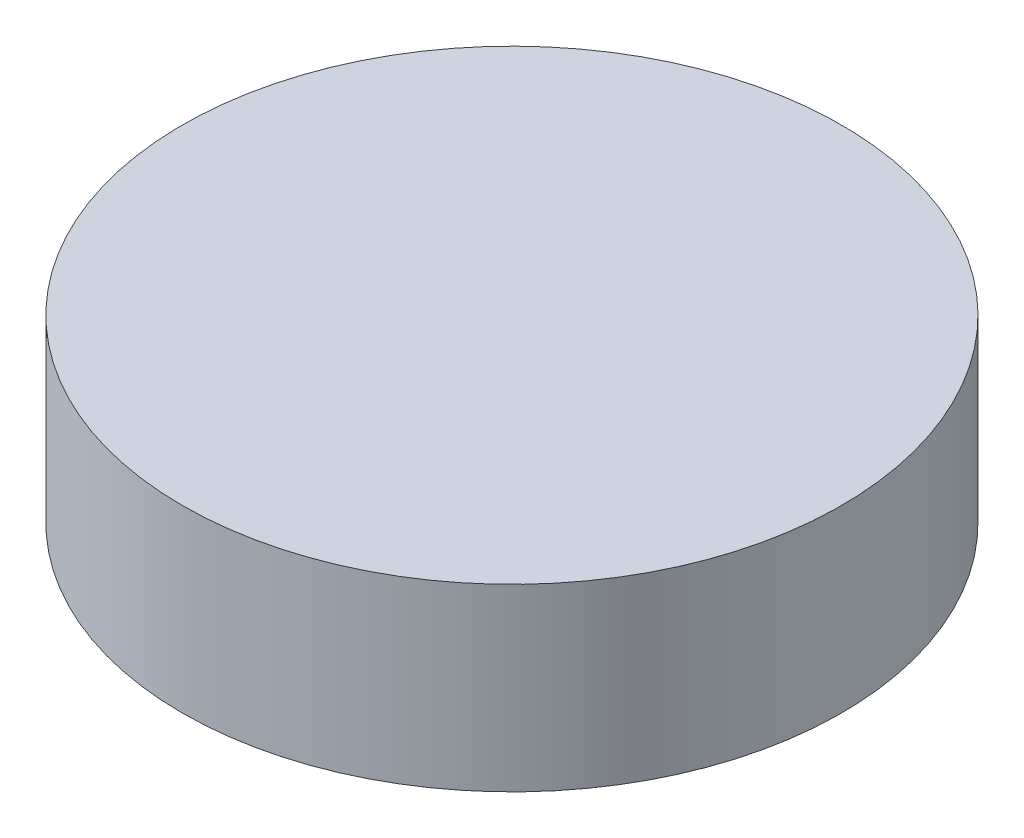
from build123d import *

# Parameters (mm, degrees)
SKETCH1_R           = 34.925
BOSS_EXTRUDE1_DEPTH = 19.05


with BuildPart() as part:
    # Sketch1 → Boss-Extrude1 (new body)
    with BuildSketch(Plane(origin=(0, 0, 0), x_dir=(1, 0, 0), z_dir=(0, 1, 0))):
        with Locations(Location((0, 0, 0), (0, 0, 270))):
            Circle(SKETCH1_R)
    extrude(amount=-BOSS_EXTRUDE1_DEPTH)


solid = part.part
